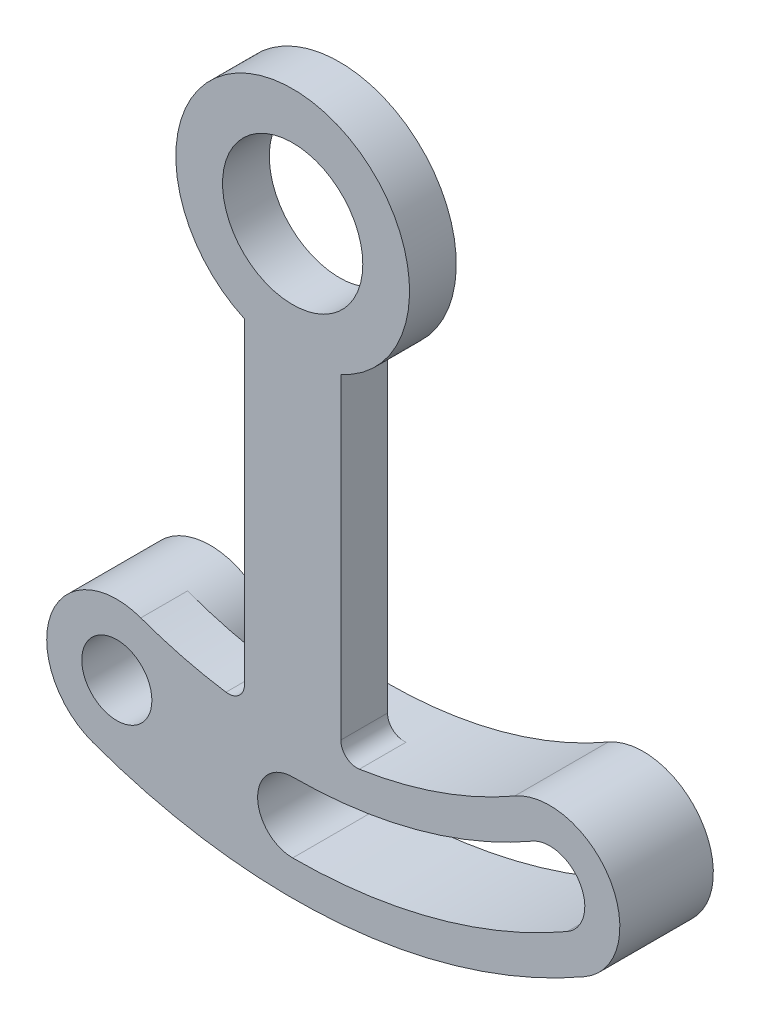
ISO-10303-21;
HEADER;
FILE_DESCRIPTION(('STEP AP214'),'2;1');
FILE_NAME('part.step','',(''),(''),'','','');
FILE_SCHEMA(('AUTOMOTIVE_DESIGN { 1 0 10303 214 1 1 1 1 }'));
ENDSEC;
DATA;
#1=APPLICATION_CONTEXT('core data for automotive mechanical design processes');
#2=APPLICATION_PROTOCOL_DEFINITION('international standard','automotive_design',2000,#1);
#3=PRODUCT_CONTEXT('',#1,'mechanical');
#4=PRODUCT('Part','Part','',(#3));
#5=PRODUCT_RELATED_PRODUCT_CATEGORY('part','',(#4));
#6=PRODUCT_DEFINITION_FORMATION('','',#4);
#7=PRODUCT_DEFINITION_CONTEXT('part definition',#1,'design');
#8=PRODUCT_DEFINITION('design','',#6,#7);
#9=PRODUCT_DEFINITION_SHAPE('','',#8);
#10=(LENGTH_UNIT() NAMED_UNIT(*) SI_UNIT(.MILLI.,.METRE.));
#11=(NAMED_UNIT(*) PLANE_ANGLE_UNIT() SI_UNIT($,.RADIAN.));
#12=(NAMED_UNIT(*) SI_UNIT($,.STERADIAN.) SOLID_ANGLE_UNIT());
#13=UNCERTAINTY_MEASURE_WITH_UNIT(LENGTH_MEASURE(1.E-05),#10,'distance_accuracy_value','');
#14=(GEOMETRIC_REPRESENTATION_CONTEXT(3) GLOBAL_UNCERTAINTY_ASSIGNED_CONTEXT((#13)) GLOBAL_UNIT_ASSIGNED_CONTEXT((#10,
#11,#12)) REPRESENTATION_CONTEXT('',''));
#15=CARTESIAN_POINT('',(0.,0.,0.));
#16=DIRECTION('',(0.,0.,1.));
#17=DIRECTION('',(1.,0.,0.));
#18=AXIS2_PLACEMENT_3D('',#15,#16,#17);
#19=CARTESIAN_POINT('',(11.,-19.0525588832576,0.));
#20=DIRECTION('',(0.,0.,1.));
#21=DIRECTION('',(1.,0.,0.));
#22=AXIS2_PLACEMENT_3D('',#19,#20,#21);
#23=PLANE('',#22);
#24=CARTESIAN_POINT('',(0.,0.,0.));
#25=DIRECTION('',(0.,0.,1.));
#26=DIRECTION('',(1.,0.,0.));
#27=AXIS2_PLACEMENT_3D('',#24,#25,#26);
#28=CIRCLE('',#27,3.);
#29=CARTESIAN_POINT('',(3.,0.,0.));
#30=VERTEX_POINT('',#29);
#31=EDGE_CURVE('E201',#30,#30,#28,.T.);
#32=ORIENTED_EDGE('',*,*,#31,.T.);
#33=EDGE_LOOP('',(#32));
#34=FACE_BOUND('',#33,.T.);
#35=CARTESIAN_POINT('',(0.,0.,0.));
#36=DIRECTION('',(0.,0.,1.));
#37=DIRECTION('',(-1.,0.,0.));
#38=AXIS2_PLACEMENT_3D('',#35,#36,#37);
#39=CIRCLE('',#38,19.);
#40=CARTESIAN_POINT('',(0.,-19.,0.));
#41=VERTEX_POINT('',#40);
#42=CARTESIAN_POINT('',(2.85313331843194,-18.7845582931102,0.));
#43=VERTEX_POINT('',#42);
#44=EDGE_CURVE('E255',#41,#43,#39,.T.);
#45=ORIENTED_EDGE('',*,*,#44,.F.);
#46=CARTESIAN_POINT('',(0.,-22.,0.));
#47=DIRECTION('',(0.,0.,-1.));
#48=DIRECTION('',(-1.,0.,0.));
#49=AXIS2_PLACEMENT_3D('',#46,#47,#48);
#50=CIRCLE('',#49,3.);
#51=CARTESIAN_POINT('',(0.,-25.,0.));
#52=VERTEX_POINT('',#51);
#53=EDGE_CURVE('E252',#52,#41,#50,.T.);
#54=ORIENTED_EDGE('',*,*,#53,.F.);
#55=CARTESIAN_POINT('',(0.,0.,0.));
#56=DIRECTION('',(0.,0.,1.));
#57=DIRECTION('',(1.,0.,0.));
#58=AXIS2_PLACEMENT_3D('',#55,#56,#57);
#59=CIRCLE('',#58,25.);
#60=CARTESIAN_POINT('',(-8.55050358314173,-23.4923155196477,0.));
#61=VERTEX_POINT('',#60);
#62=EDGE_CURVE('E208',#61,#52,#59,.T.);
#63=ORIENTED_EDGE('',*,*,#62,.F.);
#64=CARTESIAN_POINT('',(-7.52444315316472,-20.67323765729,0.));
#65=DIRECTION('',(0.,0.,-1.));
#66=DIRECTION('',(-1.,0.,0.));
#67=AXIS2_PLACEMENT_3D('',#64,#65,#66);
#68=CIRCLE('',#67,3.);
#69=CARTESIAN_POINT('',(-6.49838272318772,-17.8541597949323,0.));
#70=VERTEX_POINT('',#69);
#71=EDGE_CURVE('E85',#70,#61,#68,.T.);
#72=ORIENTED_EDGE('',*,*,#71,.F.);
#73=CARTESIAN_POINT('',(0.,0.,0.));
#74=DIRECTION('',(0.,0.,-1.));
#75=DIRECTION('',(1.,0.,0.));
#76=AXIS2_PLACEMENT_3D('',#73,#74,#75);
#77=CIRCLE('',#76,19.);
#78=CARTESIAN_POINT('',(-2.85313331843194,-18.7845582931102,0.));
#79=VERTEX_POINT('',#78);
#80=EDGE_CURVE('E131',#79,#70,#77,.T.);
#81=ORIENTED_EDGE('',*,*,#80,.F.);
#82=CARTESIAN_POINT('',(-2.74944755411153,-18.1019083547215,0.));
#83=DIRECTION('',(0.,0.,-1.));
#84=DIRECTION('',(-1.,0.,0.));
#85=AXIS2_PLACEMENT_3D('',#82,#83,#84);
#86=CIRCLE('',#85,0.690479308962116);
#87=CARTESIAN_POINT('',(-2.05896824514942,-18.1019083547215,0.));
#88=VERTEX_POINT('',#87);
#89=EDGE_CURVE('E150',#88,#79,#86,.T.);
#90=ORIENTED_EDGE('',*,*,#89,.F.);
#91=DIRECTION('',(0.,-1.,0.));
#92=VECTOR('',#91,1.);
#93=CARTESIAN_POINT('',(-2.05896824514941,-4.55638560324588,0.));
#94=LINE('',#93,#92);
#95=CARTESIAN_POINT('',(-2.05896824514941,-4.55638560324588,0.));
#96=VERTEX_POINT('',#95);
#97=EDGE_CURVE('E148',#96,#88,#94,.T.);
#98=ORIENTED_EDGE('',*,*,#97,.F.);
#99=CARTESIAN_POINT('',(0.,0.,0.));
#100=DIRECTION('',(0.,0.,1.));
#101=DIRECTION('',(1.,0.,0.));
#102=AXIS2_PLACEMENT_3D('',#99,#100,#101);
#103=CIRCLE('',#102,5.);
#104=CARTESIAN_POINT('',(2.05896824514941,-4.55638560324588,0.));
#105=VERTEX_POINT('',#104);
#106=EDGE_CURVE('E146',#105,#96,#103,.T.);
#107=ORIENTED_EDGE('',*,*,#106,.F.);
#108=DIRECTION('',(0.,1.,0.));
#109=VECTOR('',#108,1.);
#110=CARTESIAN_POINT('',(2.05896824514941,-4.55638560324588,0.));
#111=LINE('',#110,#109);
#112=CARTESIAN_POINT('',(2.05896824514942,-18.1019083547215,0.));
#113=VERTEX_POINT('',#112);
#114=EDGE_CURVE('E143',#113,#105,#111,.T.);
#115=ORIENTED_EDGE('',*,*,#114,.F.);
#116=CARTESIAN_POINT('',(2.74944755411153,-18.1019083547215,0.));
#117=DIRECTION('',(0.,0.,-1.));
#118=DIRECTION('',(1.,0.,0.));
#119=AXIS2_PLACEMENT_3D('',#116,#117,#118);
#120=CIRCLE('',#119,0.690479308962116);
#121=EDGE_CURVE('E141',#43,#113,#120,.T.);
#122=ORIENTED_EDGE('',*,*,#121,.F.);
#123=EDGE_LOOP('',(#45,#54,#63,#72,#81,#90,#98,#107,#115,#122));
#124=FACE_BOUND('',#123,.T.);
#125=ADVANCED_FACE('F31',(#34,#124),#23,.F.);
#126=CARTESIAN_POINT('',(11.,-19.0525588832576,2.));
#127=DIRECTION('',(0.,0.,1.));
#128=DIRECTION('',(1.,0.,0.));
#129=AXIS2_PLACEMENT_3D('',#126,#127,#128);
#130=PLANE('',#129);
#131=CARTESIAN_POINT('',(-7.52444315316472,-20.67323765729,2.));
#132=DIRECTION('',(0.,0.,1.));
#133=DIRECTION('',(1.,0.,0.));
#134=AXIS2_PLACEMENT_3D('',#131,#132,#133);
#135=CIRCLE('',#134,1.5);
#136=CARTESIAN_POINT('',(-6.02444315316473,-20.67323765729,2.));
#137=VERTEX_POINT('',#136);
#138=EDGE_CURVE('E198',#137,#137,#135,.T.);
#139=ORIENTED_EDGE('',*,*,#138,.F.);
#140=EDGE_LOOP('',(#139));
#141=FACE_BOUND('',#140,.T.);
#142=CARTESIAN_POINT('',(11.,-19.0525588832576,2.));
#143=DIRECTION('',(0.,0.,1.));
#144=DIRECTION('',(1.,0.,0.));
#145=AXIS2_PLACEMENT_3D('',#142,#143,#144);
#146=CIRCLE('',#145,3.);
#147=CARTESIAN_POINT('',(12.5,-21.6506350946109,2.));
#148=VERTEX_POINT('',#147);
#149=CARTESIAN_POINT('',(9.50000000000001,-16.4544826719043,2.));
#150=VERTEX_POINT('',#149);
#151=EDGE_CURVE('E206',#148,#150,#146,.T.);
#152=ORIENTED_EDGE('',*,*,#151,.T.);
#153=CARTESIAN_POINT('',(0.,0.,2.));
#154=DIRECTION('',(0.,0.,-1.));
#155=DIRECTION('',(1.,0.,0.));
#156=AXIS2_PLACEMENT_3D('',#153,#154,#155);
#157=CIRCLE('',#156,19.);
#158=CARTESIAN_POINT('',(2.85313331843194,-18.7845582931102,2.));
#159=VERTEX_POINT('',#158);
#160=EDGE_CURVE('E93',#150,#159,#157,.T.);
#161=ORIENTED_EDGE('',*,*,#160,.T.);
#162=CARTESIAN_POINT('',(2.74944755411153,-18.1019083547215,2.));
#163=DIRECTION('',(0.,0.,-1.));
#164=DIRECTION('',(1.,0.,0.));
#165=AXIS2_PLACEMENT_3D('',#162,#163,#164);
#166=CIRCLE('',#165,0.690479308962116);
#167=CARTESIAN_POINT('',(2.05896824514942,-18.1019083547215,2.));
#168=VERTEX_POINT('',#167);
#169=EDGE_CURVE('E210',#159,#168,#166,.T.);
#170=ORIENTED_EDGE('',*,*,#169,.T.);
#171=DIRECTION('',(0.,1.,0.));
#172=VECTOR('',#171,1.);
#173=CARTESIAN_POINT('',(2.05896824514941,-4.55638560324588,2.));
#174=LINE('',#173,#172);
#175=CARTESIAN_POINT('',(2.05896824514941,-4.55638560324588,2.));
#176=VERTEX_POINT('',#175);
#177=EDGE_CURVE('E212',#168,#176,#174,.T.);
#178=ORIENTED_EDGE('',*,*,#177,.T.);
#179=CARTESIAN_POINT('',(0.,0.,2.));
#180=DIRECTION('',(0.,0.,1.));
#181=DIRECTION('',(1.,0.,0.));
#182=AXIS2_PLACEMENT_3D('',#179,#180,#181);
#183=CIRCLE('',#182,5.);
#184=CARTESIAN_POINT('',(-2.05896824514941,-4.55638560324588,2.));
#185=VERTEX_POINT('',#184);
#186=EDGE_CURVE('E214',#176,#185,#183,.T.);
#187=ORIENTED_EDGE('',*,*,#186,.T.);
#188=DIRECTION('',(0.,-1.,0.));
#189=VECTOR('',#188,1.);
#190=CARTESIAN_POINT('',(-2.05896824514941,-4.55638560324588,2.));
#191=LINE('',#190,#189);
#192=CARTESIAN_POINT('',(-2.05896824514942,-18.1019083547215,2.));
#193=VERTEX_POINT('',#192);
#194=EDGE_CURVE('E216',#185,#193,#191,.T.);
#195=ORIENTED_EDGE('',*,*,#194,.T.);
#196=CARTESIAN_POINT('',(-2.74944755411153,-18.1019083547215,2.));
#197=DIRECTION('',(0.,0.,-1.));
#198=DIRECTION('',(-1.,0.,0.));
#199=AXIS2_PLACEMENT_3D('',#196,#197,#198);
#200=CIRCLE('',#199,0.690479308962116);
#201=CARTESIAN_POINT('',(-2.85313331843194,-18.7845582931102,2.));
#202=VERTEX_POINT('',#201);
#203=EDGE_CURVE('E121',#193,#202,#200,.T.);
#204=ORIENTED_EDGE('',*,*,#203,.T.);
#205=CARTESIAN_POINT('',(0.,0.,2.));
#206=DIRECTION('',(0.,0.,-1.));
#207=DIRECTION('',(1.,0.,0.));
#208=AXIS2_PLACEMENT_3D('',#205,#206,#207);
#209=CIRCLE('',#208,19.);
#210=CARTESIAN_POINT('',(-6.49838272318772,-17.8541597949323,2.));
#211=VERTEX_POINT('',#210);
#212=EDGE_CURVE('E114',#202,#211,#209,.T.);
#213=ORIENTED_EDGE('',*,*,#212,.T.);
#214=CARTESIAN_POINT('',(-7.52444315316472,-20.67323765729,2.));
#215=DIRECTION('',(0.,0.,1.));
#216=DIRECTION('',(1.,0.,0.));
#217=AXIS2_PLACEMENT_3D('',#214,#215,#216);
#218=CIRCLE('',#217,3.);
#219=CARTESIAN_POINT('',(-8.55050358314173,-23.4923155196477,2.));
#220=VERTEX_POINT('',#219);
#221=EDGE_CURVE('E119',#211,#220,#218,.T.);
#222=ORIENTED_EDGE('',*,*,#221,.T.);
#223=CARTESIAN_POINT('',(0.,0.,2.));
#224=DIRECTION('',(0.,0.,1.));
#225=DIRECTION('',(1.,0.,0.));
#226=AXIS2_PLACEMENT_3D('',#223,#224,#225);
#227=CIRCLE('',#226,25.);
#228=EDGE_CURVE('E57',#220,#148,#227,.T.);
#229=ORIENTED_EDGE('',*,*,#228,.T.);
#230=EDGE_LOOP('',(#152,#161,#170,#178,#187,#195,#204,#213,#222,#229));
#231=FACE_BOUND('',#230,.T.);
#232=CARTESIAN_POINT('',(0.,0.,2.));
#233=DIRECTION('',(0.,0.,1.));
#234=DIRECTION('',(1.,0.,0.));
#235=AXIS2_PLACEMENT_3D('',#232,#233,#234);
#236=CIRCLE('',#235,3.);
#237=CARTESIAN_POINT('',(3.,0.,2.));
#238=VERTEX_POINT('',#237);
#239=EDGE_CURVE('E144',#238,#238,#236,.T.);
#240=ORIENTED_EDGE('',*,*,#239,.F.);
#241=EDGE_LOOP('',(#240));
#242=FACE_BOUND('',#241,.T.);
#243=CARTESIAN_POINT('',(11.,-19.0525588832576,2.));
#244=DIRECTION('',(0.,0.,1.));
#245=DIRECTION('',(1.,0.,0.));
#246=AXIS2_PLACEMENT_3D('',#243,#244,#245);
#247=CIRCLE('',#246,1.5);
#248=CARTESIAN_POINT('',(11.75,-20.3515969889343,2.));
#249=VERTEX_POINT('',#248);
#250=CARTESIAN_POINT('',(10.25,-17.753520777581,2.));
#251=VERTEX_POINT('',#250);
#252=EDGE_CURVE('E181',#249,#251,#247,.T.);
#253=ORIENTED_EDGE('',*,*,#252,.F.);
#254=CARTESIAN_POINT('',(0.,0.,2.));
#255=DIRECTION('',(0.,0.,1.));
#256=DIRECTION('',(1.,0.,0.));
#257=AXIS2_PLACEMENT_3D('',#254,#255,#256);
#258=CIRCLE('',#257,23.5);
#259=CARTESIAN_POINT('',(0.,-23.5,2.));
#260=VERTEX_POINT('',#259);
#261=EDGE_CURVE('E178',#260,#249,#258,.T.);
#262=ORIENTED_EDGE('',*,*,#261,.F.);
#263=CARTESIAN_POINT('',(0.,-22.,2.));
#264=DIRECTION('',(0.,0.,1.));
#265=DIRECTION('',(1.,0.,0.));
#266=AXIS2_PLACEMENT_3D('',#263,#264,#265);
#267=CIRCLE('',#266,1.5);
#268=CARTESIAN_POINT('',(0.,-20.5,2.));
#269=VERTEX_POINT('',#268);
#270=EDGE_CURVE('E186',#269,#260,#267,.T.);
#271=ORIENTED_EDGE('',*,*,#270,.F.);
#272=CARTESIAN_POINT('',(0.,0.,2.));
#273=DIRECTION('',(0.,0.,-1.));
#274=DIRECTION('',(1.,0.,0.));
#275=AXIS2_PLACEMENT_3D('',#272,#273,#274);
#276=CIRCLE('',#275,20.5);
#277=EDGE_CURVE('E184',#251,#269,#276,.T.);
#278=ORIENTED_EDGE('',*,*,#277,.F.);
#279=EDGE_LOOP('',(#253,#262,#271,#278));
#280=FACE_BOUND('',#279,.T.);
#281=ADVANCED_FACE('F116',(#141,#231,#242,#280),#130,.T.);
#282=CARTESIAN_POINT('',(11.,-19.0525588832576,2.));
#283=DIRECTION('',(0.,0.,-1.));
#284=DIRECTION('',(-1.,0.,0.));
#285=AXIS2_PLACEMENT_3D('',#282,#283,#284);
#286=CYLINDRICAL_SURFACE('',#285,3.);
#287=DIRECTION('',(0.,0.,-1.));
#288=VECTOR('',#287,1.);
#289=CARTESIAN_POINT('',(12.5,-21.6506350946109,2.));
#290=LINE('',#289,#288);
#291=CARTESIAN_POINT('',(12.5,-21.6506350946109,-2.));
#292=VERTEX_POINT('',#291);
#293=EDGE_CURVE('E137',#148,#292,#290,.T.);
#294=ORIENTED_EDGE('',*,*,#293,.T.);
#295=CARTESIAN_POINT('',(11.,-19.0525588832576,-2.));
#296=DIRECTION('',(0.,0.,-1.));
#297=DIRECTION('',(-1.,0.,0.));
#298=AXIS2_PLACEMENT_3D('',#295,#296,#297);
#299=CIRCLE('',#298,3.);
#300=CARTESIAN_POINT('',(9.50000000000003,-16.4544826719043,-2.));
#301=VERTEX_POINT('',#300);
#302=EDGE_CURVE('E262',#301,#292,#299,.T.);
#303=ORIENTED_EDGE('',*,*,#302,.F.);
#304=DIRECTION('',(0.,0.,-1.));
#305=VECTOR('',#304,1.);
#306=CARTESIAN_POINT('',(9.50000000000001,-16.4544826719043,2.));
#307=LINE('',#306,#305);
#308=EDGE_CURVE('E11',#150,#301,#307,.T.);
#309=ORIENTED_EDGE('',*,*,#308,.F.);
#310=ORIENTED_EDGE('',*,*,#151,.F.);
#311=EDGE_LOOP('',(#294,#303,#309,#310));
#312=FACE_BOUND('',#311,.T.);
#313=ADVANCED_FACE('F33',(#312),#286,.T.);
#314=CARTESIAN_POINT('',(0.,0.,2.));
#315=DIRECTION('',(0.,0.,-1.));
#316=DIRECTION('',(-1.,0.,0.));
#317=AXIS2_PLACEMENT_3D('',#314,#315,#316);
#318=CYLINDRICAL_SURFACE('',#317,19.);
#319=ORIENTED_EDGE('',*,*,#308,.T.);
#320=CARTESIAN_POINT('',(0.,0.,-2.));
#321=DIRECTION('',(0.,0.,1.));
#322=DIRECTION('',(-1.,0.,0.));
#323=AXIS2_PLACEMENT_3D('',#320,#321,#322);
#324=CIRCLE('',#323,19.);
#325=CARTESIAN_POINT('',(0.,-19.,-2.));
#326=VERTEX_POINT('',#325);
#327=EDGE_CURVE('E259',#326,#301,#324,.T.);
#328=ORIENTED_EDGE('',*,*,#327,.F.);
#329=DIRECTION('',(0.,0.,1.));
#330=VECTOR('',#329,1.);
#331=CARTESIAN_POINT('',(0.,-19.,-2.));
#332=LINE('',#331,#330);
#333=EDGE_CURVE('E268',#326,#41,#332,.T.);
#334=ORIENTED_EDGE('',*,*,#333,.T.);
#335=ORIENTED_EDGE('',*,*,#44,.T.);
#336=DIRECTION('',(0.,0.,-1.));
#337=VECTOR('',#336,1.);
#338=CARTESIAN_POINT('',(2.85313331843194,-18.7845582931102,2.));
#339=LINE('',#338,#337);
#340=EDGE_CURVE('E40',#159,#43,#339,.T.);
#341=ORIENTED_EDGE('',*,*,#340,.F.);
#342=ORIENTED_EDGE('',*,*,#160,.F.);
#343=EDGE_LOOP('',(#319,#328,#334,#335,#341,#342));
#344=FACE_BOUND('',#343,.T.);
#345=ADVANCED_FACE('F324',(#344),#318,.F.);
#346=CARTESIAN_POINT('',(2.74944755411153,-18.1019083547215,2.));
#347=DIRECTION('',(0.,0.,-1.));
#348=DIRECTION('',(-1.,0.,0.));
#349=AXIS2_PLACEMENT_3D('',#346,#347,#348);
#350=CYLINDRICAL_SURFACE('',#349,0.690479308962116);
#351=ORIENTED_EDGE('',*,*,#121,.T.);
#352=DIRECTION('',(0.,0.,-1.));
#353=VECTOR('',#352,1.);
#354=CARTESIAN_POINT('',(2.05896824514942,-18.1019083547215,2.));
#355=LINE('',#354,#353);
#356=EDGE_CURVE('E164',#168,#113,#355,.T.);
#357=ORIENTED_EDGE('',*,*,#356,.F.);
#358=ORIENTED_EDGE('',*,*,#169,.F.);
#359=ORIENTED_EDGE('',*,*,#340,.T.);
#360=EDGE_LOOP('',(#351,#357,#358,#359));
#361=FACE_BOUND('',#360,.T.);
#362=ADVANCED_FACE('F321',(#361),#350,.F.);
#363=CARTESIAN_POINT('',(2.05896824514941,-4.55638560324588,2.));
#364=DIRECTION('',(-1.,0.,0.));
#365=DIRECTION('',(0.,-1.,0.));
#366=AXIS2_PLACEMENT_3D('',#363,#364,#365);
#367=PLANE('',#366);
#368=ORIENTED_EDGE('',*,*,#114,.T.);
#369=DIRECTION('',(0.,0.,-1.));
#370=VECTOR('',#369,1.);
#371=CARTESIAN_POINT('',(2.05896824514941,-4.55638560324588,2.));
#372=LINE('',#371,#370);
#373=EDGE_CURVE('E161',#176,#105,#372,.T.);
#374=ORIENTED_EDGE('',*,*,#373,.F.);
#375=ORIENTED_EDGE('',*,*,#177,.F.);
#376=ORIENTED_EDGE('',*,*,#356,.T.);
#377=EDGE_LOOP('',(#368,#374,#375,#376));
#378=FACE_BOUND('',#377,.T.);
#379=ADVANCED_FACE('F317',(#378),#367,.F.);
#380=CARTESIAN_POINT('',(0.,0.,2.));
#381=DIRECTION('',(0.,0.,-1.));
#382=DIRECTION('',(-1.,0.,0.));
#383=AXIS2_PLACEMENT_3D('',#380,#381,#382);
#384=CYLINDRICAL_SURFACE('',#383,5.);
#385=ORIENTED_EDGE('',*,*,#106,.T.);
#386=DIRECTION('',(0.,0.,-1.));
#387=VECTOR('',#386,1.);
#388=CARTESIAN_POINT('',(-2.05896824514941,-4.55638560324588,2.));
#389=LINE('',#388,#387);
#390=EDGE_CURVE('E158',#185,#96,#389,.T.);
#391=ORIENTED_EDGE('',*,*,#390,.F.);
#392=ORIENTED_EDGE('',*,*,#186,.F.);
#393=ORIENTED_EDGE('',*,*,#373,.T.);
#394=EDGE_LOOP('',(#385,#391,#392,#393));
#395=FACE_BOUND('',#394,.T.);
#396=ADVANCED_FACE('F314',(#395),#384,.T.);
#397=CARTESIAN_POINT('',(-2.05896824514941,-4.55638560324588,2.));
#398=DIRECTION('',(1.,0.,0.));
#399=DIRECTION('',(0.,1.,0.));
#400=AXIS2_PLACEMENT_3D('',#397,#398,#399);
#401=PLANE('',#400);
#402=ORIENTED_EDGE('',*,*,#97,.T.);
#403=DIRECTION('',(0.,0.,-1.));
#404=VECTOR('',#403,1.);
#405=CARTESIAN_POINT('',(-2.05896824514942,-18.1019083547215,2.));
#406=LINE('',#405,#404);
#407=EDGE_CURVE('E155',#193,#88,#406,.T.);
#408=ORIENTED_EDGE('',*,*,#407,.F.);
#409=ORIENTED_EDGE('',*,*,#194,.F.);
#410=ORIENTED_EDGE('',*,*,#390,.T.);
#411=EDGE_LOOP('',(#402,#408,#409,#410));
#412=FACE_BOUND('',#411,.T.);
#413=ADVANCED_FACE('F222',(#412),#401,.F.);
#414=CARTESIAN_POINT('',(-2.74944755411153,-18.1019083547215,2.));
#415=DIRECTION('',(0.,0.,-1.));
#416=DIRECTION('',(-1.,0.,0.));
#417=AXIS2_PLACEMENT_3D('',#414,#415,#416);
#418=CYLINDRICAL_SURFACE('',#417,0.690479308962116);
#419=ORIENTED_EDGE('',*,*,#89,.T.);
#420=DIRECTION('',(0.,0.,-1.));
#421=VECTOR('',#420,1.);
#422=CARTESIAN_POINT('',(-2.85313331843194,-18.7845582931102,2.));
#423=LINE('',#422,#421);
#424=EDGE_CURVE('E132',#202,#79,#423,.T.);
#425=ORIENTED_EDGE('',*,*,#424,.F.);
#426=ORIENTED_EDGE('',*,*,#203,.F.);
#427=ORIENTED_EDGE('',*,*,#407,.T.);
#428=EDGE_LOOP('',(#419,#425,#426,#427));
#429=FACE_BOUND('',#428,.T.);
#430=ADVANCED_FACE('F226',(#429),#418,.F.);
#431=CARTESIAN_POINT('',(0.,0.,2.));
#432=DIRECTION('',(0.,0.,-1.));
#433=DIRECTION('',(-1.,0.,0.));
#434=AXIS2_PLACEMENT_3D('',#431,#432,#433);
#435=CYLINDRICAL_SURFACE('',#434,19.);
#436=ORIENTED_EDGE('',*,*,#80,.T.);
#437=DIRECTION('',(0.,0.,-1.));
#438=VECTOR('',#437,1.);
#439=CARTESIAN_POINT('',(-6.49838272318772,-17.8541597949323,2.));
#440=LINE('',#439,#438);
#441=EDGE_CURVE('E127',#211,#70,#440,.T.);
#442=ORIENTED_EDGE('',*,*,#441,.F.);
#443=ORIENTED_EDGE('',*,*,#212,.F.);
#444=ORIENTED_EDGE('',*,*,#424,.T.);
#445=EDGE_LOOP('',(#436,#442,#443,#444));
#446=FACE_BOUND('',#445,.T.);
#447=ADVANCED_FACE('F128',(#446),#435,.F.);
#448=CARTESIAN_POINT('',(-7.52444315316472,-20.67323765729,2.));
#449=DIRECTION('',(0.,0.,-1.));
#450=DIRECTION('',(-1.,0.,0.));
#451=AXIS2_PLACEMENT_3D('',#448,#449,#450);
#452=CYLINDRICAL_SURFACE('',#451,3.);
#453=ORIENTED_EDGE('',*,*,#441,.T.);
#454=ORIENTED_EDGE('',*,*,#71,.T.);
#455=DIRECTION('',(0.,0.,-1.));
#456=VECTOR('',#455,1.);
#457=CARTESIAN_POINT('',(-8.55050358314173,-23.4923155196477,2.));
#458=LINE('',#457,#456);
#459=EDGE_CURVE('E133',#220,#61,#458,.T.);
#460=ORIENTED_EDGE('',*,*,#459,.F.);
#461=ORIENTED_EDGE('',*,*,#221,.F.);
#462=EDGE_LOOP('',(#453,#454,#460,#461));
#463=FACE_BOUND('',#462,.T.);
#464=CARTESIAN_POINT('',(-7.52444315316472,-20.67323765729,-2.));
#465=DIRECTION('',(0.,0.,-1.));
#466=DIRECTION('',(-1.,0.,0.));
#467=AXIS2_PLACEMENT_3D('',#464,#465,#466);
#468=CIRCLE('',#467,3.);
#469=CARTESIAN_POINT('',(-10.5244431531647,-20.67323765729,-2.));
#470=VERTEX_POINT('',#469);
#471=EDGE_CURVE('E175',#470,#470,#468,.T.);
#472=ORIENTED_EDGE('',*,*,#471,.F.);
#473=EDGE_LOOP('',(#472));
#474=FACE_BOUND('',#473,.T.);
#475=ADVANCED_FACE('F134',(#463,#474),#452,.T.);
#476=CARTESIAN_POINT('',(0.,0.,2.));
#477=DIRECTION('',(0.,0.,-1.));
#478=DIRECTION('',(-1.,0.,0.));
#479=AXIS2_PLACEMENT_3D('',#476,#477,#478);
#480=CYLINDRICAL_SURFACE('',#479,25.);
#481=ORIENTED_EDGE('',*,*,#62,.T.);
#482=DIRECTION('',(0.,0.,1.));
#483=VECTOR('',#482,1.);
#484=CARTESIAN_POINT('',(0.,-25.,-2.));
#485=LINE('',#484,#483);
#486=CARTESIAN_POINT('',(0.,-25.,-2.));
#487=VERTEX_POINT('',#486);
#488=EDGE_CURVE('E245',#487,#52,#485,.T.);
#489=ORIENTED_EDGE('',*,*,#488,.F.);
#490=CARTESIAN_POINT('',(0.,0.,-2.));
#491=DIRECTION('',(0.,0.,-1.));
#492=DIRECTION('',(-1.,0.,0.));
#493=AXIS2_PLACEMENT_3D('',#490,#491,#492);
#494=CIRCLE('',#493,25.);
#495=EDGE_CURVE('E341',#292,#487,#494,.T.);
#496=ORIENTED_EDGE('',*,*,#495,.F.);
#497=ORIENTED_EDGE('',*,*,#293,.F.);
#498=ORIENTED_EDGE('',*,*,#228,.F.);
#499=ORIENTED_EDGE('',*,*,#459,.T.);
#500=EDGE_LOOP('',(#481,#489,#496,#497,#498,#499));
#501=FACE_BOUND('',#500,.T.);
#502=ADVANCED_FACE('F241',(#501),#480,.T.);
#503=CARTESIAN_POINT('',(0.,0.,2.));
#504=DIRECTION('',(0.,0.,-1.));
#505=DIRECTION('',(-1.,0.,0.));
#506=AXIS2_PLACEMENT_3D('',#503,#504,#505);
#507=CYLINDRICAL_SURFACE('',#506,3.);
#508=ORIENTED_EDGE('',*,*,#239,.T.);
#509=EDGE_LOOP('',(#508));
#510=FACE_BOUND('',#509,.T.);
#511=ORIENTED_EDGE('',*,*,#31,.F.);
#512=EDGE_LOOP('',(#511));
#513=FACE_BOUND('',#512,.T.);
#514=ADVANCED_FACE('F305',(#510,#513),#507,.F.);
#515=CARTESIAN_POINT('',(-7.52444315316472,-20.67323765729,2.));
#516=DIRECTION('',(0.,0.,-1.));
#517=DIRECTION('',(-1.,0.,0.));
#518=AXIS2_PLACEMENT_3D('',#515,#516,#517);
#519=CYLINDRICAL_SURFACE('',#518,1.5);
#520=ORIENTED_EDGE('',*,*,#138,.T.);
#521=EDGE_LOOP('',(#520));
#522=FACE_BOUND('',#521,.T.);
#523=CARTESIAN_POINT('',(-7.52444315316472,-20.67323765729,-2.));
#524=DIRECTION('',(0.,0.,-1.));
#525=DIRECTION('',(-1.,0.,0.));
#526=AXIS2_PLACEMENT_3D('',#523,#524,#525);
#527=CIRCLE('',#526,1.5);
#528=CARTESIAN_POINT('',(-9.02444315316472,-20.67323765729,-2.));
#529=VERTEX_POINT('',#528);
#530=EDGE_CURVE('E176',#529,#529,#527,.T.);
#531=ORIENTED_EDGE('',*,*,#530,.T.);
#532=EDGE_LOOP('',(#531));
#533=FACE_BOUND('',#532,.T.);
#534=ADVANCED_FACE('F274',(#522,#533),#519,.F.);
#535=CARTESIAN_POINT('',(0.,0.,2.));
#536=DIRECTION('',(0.,0.,-1.));
#537=DIRECTION('',(-1.,0.,0.));
#538=AXIS2_PLACEMENT_3D('',#535,#536,#537);
#539=CYLINDRICAL_SURFACE('',#538,23.5);
#540=DIRECTION('',(0.,0.,-1.));
#541=VECTOR('',#540,1.);
#542=CARTESIAN_POINT('',(11.75,-20.3515969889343,2.));
#543=LINE('',#542,#541);
#544=CARTESIAN_POINT('',(11.75,-20.3515969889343,-2.));
#545=VERTEX_POINT('',#544);
#546=EDGE_CURVE('E195',#249,#545,#543,.T.);
#547=ORIENTED_EDGE('',*,*,#546,.T.);
#548=CARTESIAN_POINT('',(0.,0.,-2.));
#549=DIRECTION('',(0.,0.,-1.));
#550=DIRECTION('',(-1.,0.,0.));
#551=AXIS2_PLACEMENT_3D('',#548,#549,#550);
#552=CIRCLE('',#551,23.5);
#553=CARTESIAN_POINT('',(0.,-23.5,-2.));
#554=VERTEX_POINT('',#553);
#555=EDGE_CURVE('E369',#545,#554,#552,.T.);
#556=ORIENTED_EDGE('',*,*,#555,.T.);
#557=DIRECTION('',(0.,0.,-1.));
#558=VECTOR('',#557,1.);
#559=CARTESIAN_POINT('',(0.,-23.5,2.));
#560=LINE('',#559,#558);
#561=EDGE_CURVE('E188',#260,#554,#560,.T.);
#562=ORIENTED_EDGE('',*,*,#561,.F.);
#563=ORIENTED_EDGE('',*,*,#261,.T.);
#564=EDGE_LOOP('',(#547,#556,#562,#563));
#565=FACE_BOUND('',#564,.T.);
#566=ADVANCED_FACE('F367',(#565),#539,.F.);
#567=CARTESIAN_POINT('',(11.,-19.0525588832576,2.));
#568=DIRECTION('',(0.,0.,-1.));
#569=DIRECTION('',(-1.,0.,0.));
#570=AXIS2_PLACEMENT_3D('',#567,#568,#569);
#571=CYLINDRICAL_SURFACE('',#570,1.5);
#572=DIRECTION('',(0.,0.,-1.));
#573=VECTOR('',#572,1.);
#574=CARTESIAN_POINT('',(10.25,-17.753520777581,2.));
#575=LINE('',#574,#573);
#576=CARTESIAN_POINT('',(10.25,-17.753520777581,-2.));
#577=VERTEX_POINT('',#576);
#578=EDGE_CURVE('E192',#251,#577,#575,.T.);
#579=ORIENTED_EDGE('',*,*,#578,.T.);
#580=CARTESIAN_POINT('',(11.,-19.0525588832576,-2.));
#581=DIRECTION('',(0.,0.,-1.));
#582=DIRECTION('',(-1.,0.,0.));
#583=AXIS2_PLACEMENT_3D('',#580,#581,#582);
#584=CIRCLE('',#583,1.5);
#585=EDGE_CURVE('E264',#577,#545,#584,.T.);
#586=ORIENTED_EDGE('',*,*,#585,.T.);
#587=ORIENTED_EDGE('',*,*,#546,.F.);
#588=ORIENTED_EDGE('',*,*,#252,.T.);
#589=EDGE_LOOP('',(#579,#586,#587,#588));
#590=FACE_BOUND('',#589,.T.);
#591=ADVANCED_FACE('F378',(#590),#571,.F.);
#592=CARTESIAN_POINT('',(0.,0.,2.));
#593=DIRECTION('',(0.,0.,-1.));
#594=DIRECTION('',(-1.,0.,0.));
#595=AXIS2_PLACEMENT_3D('',#592,#593,#594);
#596=CYLINDRICAL_SURFACE('',#595,20.5);
#597=DIRECTION('',(0.,0.,-1.));
#598=VECTOR('',#597,1.);
#599=CARTESIAN_POINT('',(0.,-20.5,2.));
#600=LINE('',#599,#598);
#601=CARTESIAN_POINT('',(0.,-20.5,-2.));
#602=VERTEX_POINT('',#601);
#603=EDGE_CURVE('E48',#269,#602,#600,.T.);
#604=ORIENTED_EDGE('',*,*,#603,.T.);
#605=CARTESIAN_POINT('',(0.,0.,-2.));
#606=DIRECTION('',(0.,0.,1.));
#607=DIRECTION('',(-1.,0.,0.));
#608=AXIS2_PLACEMENT_3D('',#605,#606,#607);
#609=CIRCLE('',#608,20.5);
#610=EDGE_CURVE('E375',#602,#577,#609,.T.);
#611=ORIENTED_EDGE('',*,*,#610,.T.);
#612=ORIENTED_EDGE('',*,*,#578,.F.);
#613=ORIENTED_EDGE('',*,*,#277,.T.);
#614=EDGE_LOOP('',(#604,#611,#612,#613));
#615=FACE_BOUND('',#614,.T.);
#616=ADVANCED_FACE('F289',(#615),#596,.T.);
#617=CARTESIAN_POINT('',(0.,-22.,2.));
#618=DIRECTION('',(0.,0.,-1.));
#619=DIRECTION('',(-1.,0.,0.));
#620=AXIS2_PLACEMENT_3D('',#617,#618,#619);
#621=CYLINDRICAL_SURFACE('',#620,1.5);
#622=ORIENTED_EDGE('',*,*,#561,.T.);
#623=CARTESIAN_POINT('',(0.,-22.,-2.));
#624=DIRECTION('',(0.,0.,-1.));
#625=DIRECTION('',(-1.,0.,0.));
#626=AXIS2_PLACEMENT_3D('',#623,#624,#625);
#627=CIRCLE('',#626,1.5);
#628=EDGE_CURVE('E381',#554,#602,#627,.T.);
#629=ORIENTED_EDGE('',*,*,#628,.T.);
#630=ORIENTED_EDGE('',*,*,#603,.F.);
#631=ORIENTED_EDGE('',*,*,#270,.T.);
#632=EDGE_LOOP('',(#622,#629,#630,#631));
#633=FACE_BOUND('',#632,.T.);
#634=ADVANCED_FACE('F279',(#633),#621,.F.);
#635=CARTESIAN_POINT('',(-7.52444315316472,-20.67323765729,-2.));
#636=DIRECTION('',(0.,0.,-1.));
#637=DIRECTION('',(-1.,0.,0.));
#638=AXIS2_PLACEMENT_3D('',#635,#636,#637);
#639=PLANE('',#638);
#640=ORIENTED_EDGE('',*,*,#471,.T.);
#641=EDGE_LOOP('',(#640));
#642=FACE_BOUND('',#641,.T.);
#643=ORIENTED_EDGE('',*,*,#530,.F.);
#644=EDGE_LOOP('',(#643));
#645=FACE_BOUND('',#644,.T.);
#646=ADVANCED_FACE('F276',(#642,#645),#639,.T.);
#647=CARTESIAN_POINT('',(0.,-11.,-2.));
#648=DIRECTION('',(0.,0.,-1.));
#649=DIRECTION('',(-1.,0.,0.));
#650=AXIS2_PLACEMENT_3D('',#647,#648,#649);
#651=PLANE('',#650);
#652=ORIENTED_EDGE('',*,*,#327,.T.);
#653=ORIENTED_EDGE('',*,*,#302,.T.);
#654=ORIENTED_EDGE('',*,*,#495,.T.);
#655=CARTESIAN_POINT('',(0.,-22.,-2.));
#656=DIRECTION('',(0.,0.,-1.));
#657=DIRECTION('',(-1.,0.,0.));
#658=AXIS2_PLACEMENT_3D('',#655,#656,#657);
#659=CIRCLE('',#658,3.);
#660=EDGE_CURVE('E270',#487,#326,#659,.T.);
#661=ORIENTED_EDGE('',*,*,#660,.T.);
#662=EDGE_LOOP('',(#652,#653,#654,#661));
#663=FACE_BOUND('',#662,.T.);
#664=ORIENTED_EDGE('',*,*,#628,.F.);
#665=ORIENTED_EDGE('',*,*,#555,.F.);
#666=ORIENTED_EDGE('',*,*,#585,.F.);
#667=ORIENTED_EDGE('',*,*,#610,.F.);
#668=EDGE_LOOP('',(#664,#665,#666,#667));
#669=FACE_BOUND('',#668,.T.);
#670=ADVANCED_FACE('F278',(#663,#669),#651,.T.);
#671=CARTESIAN_POINT('',(0.,-22.,-2.));
#672=DIRECTION('',(0.,0.,1.));
#673=DIRECTION('',(1.,0.,0.));
#674=AXIS2_PLACEMENT_3D('',#671,#672,#673);
#675=CYLINDRICAL_SURFACE('',#674,3.);
#676=ORIENTED_EDGE('',*,*,#53,.T.);
#677=ORIENTED_EDGE('',*,*,#333,.F.);
#678=ORIENTED_EDGE('',*,*,#660,.F.);
#679=ORIENTED_EDGE('',*,*,#488,.T.);
#680=EDGE_LOOP('',(#676,#677,#678,#679));
#681=FACE_BOUND('',#680,.T.);
#682=ADVANCED_FACE('F286',(#681),#675,.T.);
#683=CLOSED_SHELL('',(#125,#281,#313,#345,#362,#379,#396,#413,#430,#447,#475,#502,#514,#534,
#566,#591,#616,#634,#646,#670,#682));
#684=MANIFOLD_SOLID_BREP('B2',#683);
#685=ADVANCED_BREP_SHAPE_REPRESENTATION('',(#18,#684),#14);
#686=SHAPE_DEFINITION_REPRESENTATION(#9,#685);
ENDSEC;
END-ISO-10303-21;
